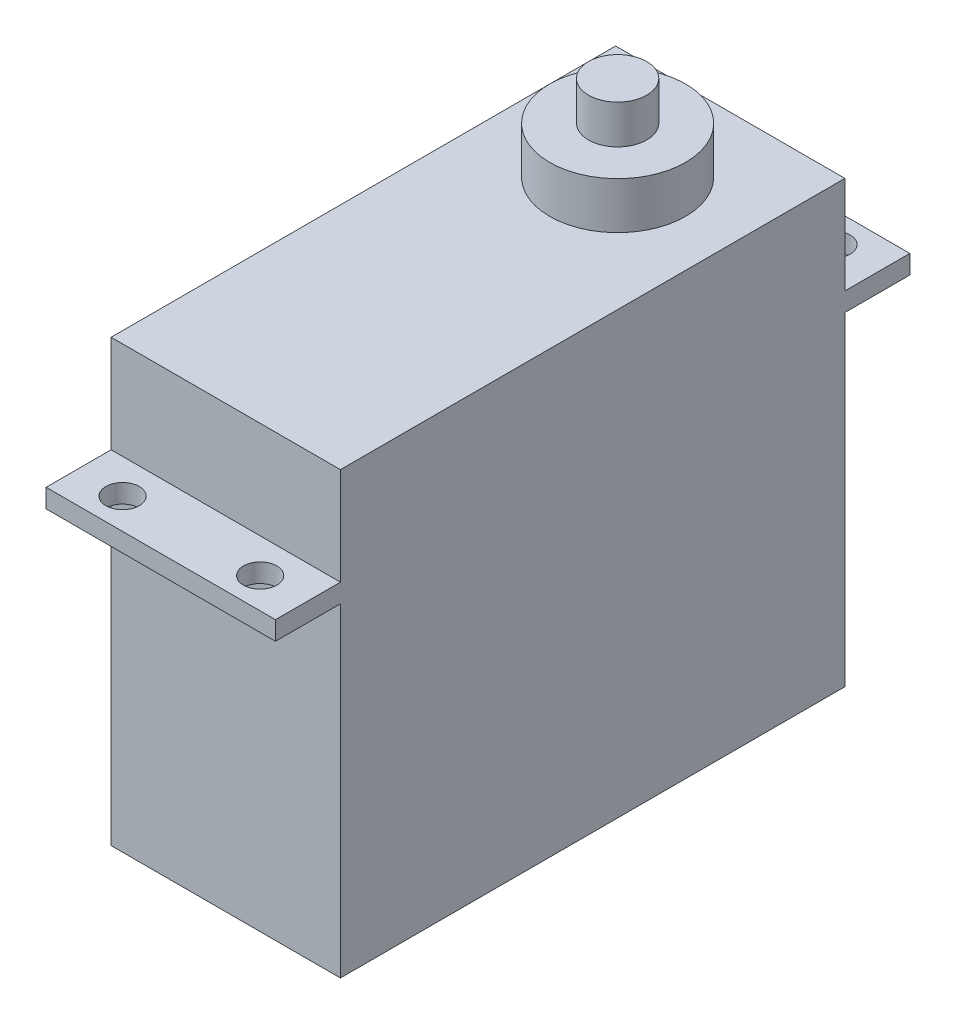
ISO-10303-21;
HEADER;
FILE_DESCRIPTION(('STEP AP214'),'2;1');
FILE_NAME('part.step','',(''),(''),'','','');
FILE_SCHEMA(('AUTOMOTIVE_DESIGN { 1 0 10303 214 1 1 1 1 }'));
ENDSEC;
DATA;
#1=APPLICATION_CONTEXT('core data for automotive mechanical design processes');
#2=APPLICATION_PROTOCOL_DEFINITION('international standard','automotive_design',2000,#1);
#3=PRODUCT_CONTEXT('',#1,'mechanical');
#4=PRODUCT('Part','Part','',(#3));
#5=PRODUCT_RELATED_PRODUCT_CATEGORY('part','',(#4));
#6=PRODUCT_DEFINITION_FORMATION('','',#4);
#7=PRODUCT_DEFINITION_CONTEXT('part definition',#1,'design');
#8=PRODUCT_DEFINITION('design','',#6,#7);
#9=PRODUCT_DEFINITION_SHAPE('','',#8);
#10=(LENGTH_UNIT() NAMED_UNIT(*) SI_UNIT(.MILLI.,.METRE.));
#11=(NAMED_UNIT(*) PLANE_ANGLE_UNIT() SI_UNIT($,.RADIAN.));
#12=(NAMED_UNIT(*) SI_UNIT($,.STERADIAN.) SOLID_ANGLE_UNIT());
#13=UNCERTAINTY_MEASURE_WITH_UNIT(LENGTH_MEASURE(1.E-05),#10,'distance_accuracy_value','');
#14=(GEOMETRIC_REPRESENTATION_CONTEXT(3) GLOBAL_UNCERTAINTY_ASSIGNED_CONTEXT((#13)) GLOBAL_UNIT_ASSIGNED_CONTEXT((#10,
#11,#12)) REPRESENTATION_CONTEXT('',''));
#15=CARTESIAN_POINT('',(0.,0.,0.));
#16=DIRECTION('',(0.,0.,1.));
#17=DIRECTION('',(1.,0.,0.));
#18=AXIS2_PLACEMENT_3D('',#15,#16,#17);
#19=CARTESIAN_POINT('',(0.,63.72,-18.268));
#20=DIRECTION('',(0.,1.,0.));
#21=DIRECTION('',(0.,0.,1.));
#22=AXIS2_PLACEMENT_3D('',#19,#20,#21);
#23=PLANE('',#22);
#24=CARTESIAN_POINT('',(0.,63.72,-18.268));
#25=DIRECTION('',(0.,1.,0.));
#26=DIRECTION('',(0.,0.,1.));
#27=AXIS2_PLACEMENT_3D('',#24,#25,#26);
#28=CIRCLE('',#27,8.88999999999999);
#29=CARTESIAN_POINT('',(0.,63.72,-9.37800000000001));
#30=VERTEX_POINT('',#29);
#31=EDGE_CURVE('E248',#30,#30,#28,.T.);
#32=ORIENTED_EDGE('',*,*,#31,.T.);
#33=EDGE_LOOP('',(#32));
#34=FACE_BOUND('',#33,.T.);
#35=CARTESIAN_POINT('',(0.,63.72,-18.268));
#36=DIRECTION('',(0.,1.,0.));
#37=DIRECTION('',(0.,0.,1.));
#38=AXIS2_PLACEMENT_3D('',#35,#36,#37);
#39=CIRCLE('',#38,3.81);
#40=CARTESIAN_POINT('',(0.,63.72,-14.458));
#41=VERTEX_POINT('',#40);
#42=EDGE_CURVE('E256',#41,#41,#39,.T.);
#43=ORIENTED_EDGE('',*,*,#42,.F.);
#44=EDGE_LOOP('',(#43));
#45=FACE_BOUND('',#44,.T.);
#46=ADVANCED_FACE('F31',(#34,#45),#23,.T.);
#47=CARTESIAN_POINT('',(-15.,57.6,33.));
#48=DIRECTION('',(0.,1.,0.));
#49=DIRECTION('',(0.,0.,1.));
#50=AXIS2_PLACEMENT_3D('',#47,#48,#49);
#51=PLANE('',#50);
#52=DIRECTION('',(0.,0.,1.));
#53=VECTOR('',#52,1.);
#54=CARTESIAN_POINT('',(-15.,57.6,-33.));
#55=LINE('',#54,#53);
#56=CARTESIAN_POINT('',(-15.,57.6,-33.));
#57=VERTEX_POINT('',#56);
#58=CARTESIAN_POINT('',(-15.,57.6,33.));
#59=VERTEX_POINT('',#58);
#60=EDGE_CURVE('E457',#57,#59,#55,.T.);
#61=ORIENTED_EDGE('',*,*,#60,.T.);
#62=DIRECTION('',(1.,0.,0.));
#63=VECTOR('',#62,1.);
#64=CARTESIAN_POINT('',(-15.,57.6,33.));
#65=LINE('',#64,#63);
#66=CARTESIAN_POINT('',(15.,57.6,33.));
#67=VERTEX_POINT('',#66);
#68=EDGE_CURVE('E490',#59,#67,#65,.T.);
#69=ORIENTED_EDGE('',*,*,#68,.T.);
#70=DIRECTION('',(0.,0.,-1.));
#71=VECTOR('',#70,1.);
#72=CARTESIAN_POINT('',(15.,57.6,-33.));
#73=LINE('',#72,#71);
#74=CARTESIAN_POINT('',(15.,57.6,-33.));
#75=VERTEX_POINT('',#74);
#76=EDGE_CURVE('E491',#67,#75,#73,.T.);
#77=ORIENTED_EDGE('',*,*,#76,.T.);
#78=DIRECTION('',(-1.,0.,0.));
#79=VECTOR('',#78,1.);
#80=CARTESIAN_POINT('',(-15.,57.6,-33.));
#81=LINE('',#80,#79);
#82=EDGE_CURVE('E451',#75,#57,#81,.T.);
#83=ORIENTED_EDGE('',*,*,#82,.T.);
#84=EDGE_LOOP('',(#61,#69,#77,#83));
#85=FACE_BOUND('',#84,.T.);
#86=CARTESIAN_POINT('',(0.,57.6,-18.268));
#87=DIRECTION('',(0.,1.,0.));
#88=DIRECTION('',(0.,0.,1.));
#89=AXIS2_PLACEMENT_3D('',#86,#87,#88);
#90=CIRCLE('',#89,8.88999999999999);
#91=CARTESIAN_POINT('',(0.,57.6,-9.37800000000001));
#92=VERTEX_POINT('',#91);
#93=EDGE_CURVE('E251',#92,#92,#90,.T.);
#94=ORIENTED_EDGE('',*,*,#93,.F.);
#95=EDGE_LOOP('',(#94));
#96=FACE_BOUND('',#95,.T.);
#97=ADVANCED_FACE('F211',(#85,#96),#51,.T.);
#98=CARTESIAN_POINT('',(-15.,42.4,41.5));
#99=DIRECTION('',(0.,1.,0.));
#100=DIRECTION('',(0.,0.,1.));
#101=AXIS2_PLACEMENT_3D('',#98,#99,#100);
#102=PLANE('',#101);
#103=DIRECTION('',(1.,0.,0.));
#104=VECTOR('',#103,1.);
#105=CARTESIAN_POINT('',(-15.,42.4,33.));
#106=LINE('',#105,#104);
#107=CARTESIAN_POINT('',(-15.,42.4,33.));
#108=VERTEX_POINT('',#107);
#109=CARTESIAN_POINT('',(15.,42.4,33.));
#110=VERTEX_POINT('',#109);
#111=EDGE_CURVE('E56',#108,#110,#106,.T.);
#112=ORIENTED_EDGE('',*,*,#111,.T.);
#113=DIRECTION('',(0.,0.,-1.));
#114=VECTOR('',#113,1.);
#115=CARTESIAN_POINT('',(15.,42.4,41.5));
#116=LINE('',#115,#114);
#117=CARTESIAN_POINT('',(15.,42.4,41.5));
#118=VERTEX_POINT('',#117);
#119=EDGE_CURVE('E448',#118,#110,#116,.T.);
#120=ORIENTED_EDGE('',*,*,#119,.F.);
#121=DIRECTION('',(1.,0.,0.));
#122=VECTOR('',#121,1.);
#123=CARTESIAN_POINT('',(-15.,42.4,41.5));
#124=LINE('',#123,#122);
#125=CARTESIAN_POINT('',(-15.,42.4,41.5));
#126=VERTEX_POINT('',#125);
#127=EDGE_CURVE('E518',#126,#118,#124,.T.);
#128=ORIENTED_EDGE('',*,*,#127,.F.);
#129=DIRECTION('',(0.,0.,-1.));
#130=VECTOR('',#129,1.);
#131=CARTESIAN_POINT('',(-15.,42.4,41.5));
#132=LINE('',#131,#130);
#133=EDGE_CURVE('E443',#126,#108,#132,.T.);
#134=ORIENTED_EDGE('',*,*,#133,.T.);
#135=EDGE_LOOP('',(#112,#120,#128,#134));
#136=FACE_BOUND('',#135,.T.);
#137=CARTESIAN_POINT('',(9.,42.4,37.5));
#138=DIRECTION('',(0.,1.,0.));
#139=DIRECTION('',(0.,0.,1.));
#140=AXIS2_PLACEMENT_3D('',#137,#138,#139);
#141=CIRCLE('',#140,2.1844);
#142=CARTESIAN_POINT('',(9.,42.4,39.6844));
#143=VERTEX_POINT('',#142);
#144=EDGE_CURVE('E157',#143,#143,#141,.T.);
#145=ORIENTED_EDGE('',*,*,#144,.T.);
#146=EDGE_LOOP('',(#145));
#147=FACE_BOUND('',#146,.T.);
#148=CARTESIAN_POINT('',(-9.,42.4,37.5));
#149=DIRECTION('',(0.,1.,0.));
#150=DIRECTION('',(0.,0.,1.));
#151=AXIS2_PLACEMENT_3D('',#148,#149,#150);
#152=CIRCLE('',#151,2.1844);
#153=CARTESIAN_POINT('',(-9.,42.4,39.6844));
#154=VERTEX_POINT('',#153);
#155=EDGE_CURVE('E242',#154,#154,#152,.F.);
#156=ORIENTED_EDGE('',*,*,#155,.F.);
#157=EDGE_LOOP('',(#156));
#158=FACE_BOUND('',#157,.T.);
#159=ADVANCED_FACE('F193',(#136,#147,#158),#102,.F.);
#160=CARTESIAN_POINT('',(-15.,44.85,41.5));
#161=DIRECTION('',(0.,-1.,0.));
#162=DIRECTION('',(0.,0.,-1.));
#163=AXIS2_PLACEMENT_3D('',#160,#161,#162);
#164=PLANE('',#163);
#165=DIRECTION('',(-1.,0.,0.));
#166=VECTOR('',#165,1.);
#167=CARTESIAN_POINT('',(-15.,44.85,33.));
#168=LINE('',#167,#166);
#169=CARTESIAN_POINT('',(15.,44.85,33.));
#170=VERTEX_POINT('',#169);
#171=CARTESIAN_POINT('',(-15.,44.85,33.));
#172=VERTEX_POINT('',#171);
#173=EDGE_CURVE('E477',#170,#172,#168,.T.);
#174=ORIENTED_EDGE('',*,*,#173,.T.);
#175=DIRECTION('',(0.,0.,-1.));
#176=VECTOR('',#175,1.);
#177=CARTESIAN_POINT('',(-15.,44.85,41.5));
#178=LINE('',#177,#176);
#179=CARTESIAN_POINT('',(-15.,44.85,41.5));
#180=VERTEX_POINT('',#179);
#181=EDGE_CURVE('E471',#180,#172,#178,.T.);
#182=ORIENTED_EDGE('',*,*,#181,.F.);
#183=DIRECTION('',(-1.,0.,0.));
#184=VECTOR('',#183,1.);
#185=CARTESIAN_POINT('',(-15.,44.85,41.5));
#186=LINE('',#185,#184);
#187=CARTESIAN_POINT('',(15.,44.85,41.5));
#188=VERTEX_POINT('',#187);
#189=EDGE_CURVE('E476',#188,#180,#186,.T.);
#190=ORIENTED_EDGE('',*,*,#189,.F.);
#191=DIRECTION('',(0.,0.,-1.));
#192=VECTOR('',#191,1.);
#193=CARTESIAN_POINT('',(15.,44.85,41.5));
#194=LINE('',#193,#192);
#195=EDGE_CURVE('E468',#188,#170,#194,.T.);
#196=ORIENTED_EDGE('',*,*,#195,.T.);
#197=EDGE_LOOP('',(#174,#182,#190,#196));
#198=FACE_BOUND('',#197,.T.);
#199=CARTESIAN_POINT('',(9.,44.85,37.5));
#200=DIRECTION('',(0.,1.,0.));
#201=DIRECTION('',(0.,0.,1.));
#202=AXIS2_PLACEMENT_3D('',#199,#200,#201);
#203=CIRCLE('',#202,2.1844);
#204=CARTESIAN_POINT('',(9.,44.85,39.6844));
#205=VERTEX_POINT('',#204);
#206=EDGE_CURVE('E177',#205,#205,#203,.T.);
#207=ORIENTED_EDGE('',*,*,#206,.F.);
#208=EDGE_LOOP('',(#207));
#209=FACE_BOUND('',#208,.T.);
#210=CARTESIAN_POINT('',(-9.,44.85,37.5));
#211=DIRECTION('',(0.,-1.,0.));
#212=DIRECTION('',(0.,0.,1.));
#213=AXIS2_PLACEMENT_3D('',#210,#211,#212);
#214=CIRCLE('',#213,2.1844);
#215=CARTESIAN_POINT('',(-9.,44.85,39.6844));
#216=VERTEX_POINT('',#215);
#217=EDGE_CURVE('E244',#216,#216,#214,.T.);
#218=ORIENTED_EDGE('',*,*,#217,.T.);
#219=EDGE_LOOP('',(#218));
#220=FACE_BOUND('',#219,.T.);
#221=ADVANCED_FACE('F326',(#198,#209,#220),#164,.F.);
#222=CARTESIAN_POINT('',(-15.,44.85,-41.5));
#223=DIRECTION('',(0.,1.,0.));
#224=DIRECTION('',(0.,0.,1.));
#225=AXIS2_PLACEMENT_3D('',#222,#223,#224);
#226=PLANE('',#225);
#227=CARTESIAN_POINT('',(-9.,44.85,-37.5));
#228=DIRECTION('',(0.,1.,0.));
#229=DIRECTION('',(0.,0.,-1.));
#230=AXIS2_PLACEMENT_3D('',#227,#228,#229);
#231=CIRCLE('',#230,2.1844);
#232=CARTESIAN_POINT('',(-9.,44.85,-39.6844));
#233=VERTEX_POINT('',#232);
#234=EDGE_CURVE('E187',#233,#233,#231,.T.);
#235=ORIENTED_EDGE('',*,*,#234,.F.);
#236=EDGE_LOOP('',(#235));
#237=FACE_BOUND('',#236,.T.);
#238=DIRECTION('',(-1.,0.,0.));
#239=VECTOR('',#238,1.);
#240=CARTESIAN_POINT('',(-15.,44.85,-33.));
#241=LINE('',#240,#239);
#242=CARTESIAN_POINT('',(15.,44.85,-33.));
#243=VERTEX_POINT('',#242);
#244=CARTESIAN_POINT('',(-15.,44.85,-33.));
#245=VERTEX_POINT('',#244);
#246=EDGE_CURVE('E155',#243,#245,#241,.T.);
#247=ORIENTED_EDGE('',*,*,#246,.F.);
#248=DIRECTION('',(0.,0.,1.));
#249=VECTOR('',#248,1.);
#250=CARTESIAN_POINT('',(15.,44.85,-41.5));
#251=LINE('',#250,#249);
#252=CARTESIAN_POINT('',(15.,44.85,-41.5));
#253=VERTEX_POINT('',#252);
#254=EDGE_CURVE('E129',#253,#243,#251,.T.);
#255=ORIENTED_EDGE('',*,*,#254,.F.);
#256=DIRECTION('',(-1.,0.,0.));
#257=VECTOR('',#256,1.);
#258=CARTESIAN_POINT('',(-15.,44.85,-41.5));
#259=LINE('',#258,#257);
#260=CARTESIAN_POINT('',(-15.,44.85,-41.5));
#261=VERTEX_POINT('',#260);
#262=EDGE_CURVE('E135',#253,#261,#259,.T.);
#263=ORIENTED_EDGE('',*,*,#262,.T.);
#264=DIRECTION('',(0.,0.,1.));
#265=VECTOR('',#264,1.);
#266=CARTESIAN_POINT('',(-15.,44.85,-41.5));
#267=LINE('',#266,#265);
#268=EDGE_CURVE('E48',#261,#245,#267,.T.);
#269=ORIENTED_EDGE('',*,*,#268,.T.);
#270=EDGE_LOOP('',(#247,#255,#263,#269));
#271=FACE_BOUND('',#270,.T.);
#272=CARTESIAN_POINT('',(9.,44.85,-37.5));
#273=DIRECTION('',(0.,-1.,0.));
#274=DIRECTION('',(0.,0.,-1.));
#275=AXIS2_PLACEMENT_3D('',#272,#273,#274);
#276=CIRCLE('',#275,2.1844);
#277=CARTESIAN_POINT('',(9.,44.85,-39.6844));
#278=VERTEX_POINT('',#277);
#279=EDGE_CURVE('E178',#278,#278,#276,.T.);
#280=ORIENTED_EDGE('',*,*,#279,.T.);
#281=EDGE_LOOP('',(#280));
#282=FACE_BOUND('',#281,.T.);
#283=ADVANCED_FACE('F141',(#237,#271,#282),#226,.T.);
#284=CARTESIAN_POINT('',(-15.,42.4,-41.5));
#285=DIRECTION('',(0.,-1.,0.));
#286=DIRECTION('',(0.,0.,-1.));
#287=AXIS2_PLACEMENT_3D('',#284,#285,#286);
#288=PLANE('',#287);
#289=CARTESIAN_POINT('',(-9.,42.4,-37.5));
#290=DIRECTION('',(0.,-1.,0.));
#291=DIRECTION('',(0.,0.,-1.));
#292=AXIS2_PLACEMENT_3D('',#289,#290,#291);
#293=CIRCLE('',#292,2.1844);
#294=CARTESIAN_POINT('',(-9.,42.4,-39.6844));
#295=VERTEX_POINT('',#294);
#296=EDGE_CURVE('E35',#295,#295,#293,.T.);
#297=ORIENTED_EDGE('',*,*,#296,.F.);
#298=EDGE_LOOP('',(#297));
#299=FACE_BOUND('',#298,.T.);
#300=DIRECTION('',(1.,0.,0.));
#301=VECTOR('',#300,1.);
#302=CARTESIAN_POINT('',(-15.,42.4,-33.));
#303=LINE('',#302,#301);
#304=CARTESIAN_POINT('',(-15.,42.4,-33.));
#305=VERTEX_POINT('',#304);
#306=CARTESIAN_POINT('',(15.,42.4,-33.));
#307=VERTEX_POINT('',#306);
#308=EDGE_CURVE('E139',#305,#307,#303,.T.);
#309=ORIENTED_EDGE('',*,*,#308,.F.);
#310=DIRECTION('',(0.,0.,1.));
#311=VECTOR('',#310,1.);
#312=CARTESIAN_POINT('',(-15.,42.4,-41.5));
#313=LINE('',#312,#311);
#314=CARTESIAN_POINT('',(-15.,42.4,-41.5));
#315=VERTEX_POINT('',#314);
#316=EDGE_CURVE('E149',#315,#305,#313,.T.);
#317=ORIENTED_EDGE('',*,*,#316,.F.);
#318=DIRECTION('',(1.,0.,0.));
#319=VECTOR('',#318,1.);
#320=CARTESIAN_POINT('',(-15.,42.4,-41.5));
#321=LINE('',#320,#319);
#322=CARTESIAN_POINT('',(15.,42.4,-41.5));
#323=VERTEX_POINT('',#322);
#324=EDGE_CURVE('E138',#315,#323,#321,.T.);
#325=ORIENTED_EDGE('',*,*,#324,.T.);
#326=DIRECTION('',(0.,0.,1.));
#327=VECTOR('',#326,1.);
#328=CARTESIAN_POINT('',(15.,42.4,-41.5));
#329=LINE('',#328,#327);
#330=EDGE_CURVE('E165',#323,#307,#329,.T.);
#331=ORIENTED_EDGE('',*,*,#330,.T.);
#332=EDGE_LOOP('',(#309,#317,#325,#331));
#333=FACE_BOUND('',#332,.T.);
#334=CARTESIAN_POINT('',(9.,42.4,-37.5));
#335=DIRECTION('',(0.,-1.,0.));
#336=DIRECTION('',(0.,0.,-1.));
#337=AXIS2_PLACEMENT_3D('',#334,#335,#336);
#338=CIRCLE('',#337,2.1844);
#339=CARTESIAN_POINT('',(9.,42.4,-39.6844));
#340=VERTEX_POINT('',#339);
#341=EDGE_CURVE('E175',#340,#340,#338,.F.);
#342=ORIENTED_EDGE('',*,*,#341,.T.);
#343=EDGE_LOOP('',(#342));
#344=FACE_BOUND('',#343,.T.);
#345=ADVANCED_FACE('F309',(#299,#333,#344),#288,.T.);
#346=CARTESIAN_POINT('',(-15.,57.6,-33.));
#347=DIRECTION('',(0.,0.,1.));
#348=DIRECTION('',(1.,0.,0.));
#349=AXIS2_PLACEMENT_3D('',#346,#347,#348);
#350=PLANE('',#349);
#351=DIRECTION('',(0.,-1.,0.));
#352=VECTOR('',#351,1.);
#353=CARTESIAN_POINT('',(-15.,57.6,-33.));
#354=LINE('',#353,#352);
#355=CARTESIAN_POINT('',(-15.,0.,-33.));
#356=VERTEX_POINT('',#355);
#357=EDGE_CURVE('E463',#305,#356,#354,.T.);
#358=ORIENTED_EDGE('',*,*,#357,.F.);
#359=ORIENTED_EDGE('',*,*,#308,.T.);
#360=DIRECTION('',(0.,-1.,0.));
#361=VECTOR('',#360,1.);
#362=CARTESIAN_POINT('',(15.,57.6,-33.));
#363=LINE('',#362,#361);
#364=CARTESIAN_POINT('',(15.,0.,-33.));
#365=VERTEX_POINT('',#364);
#366=EDGE_CURVE('E158',#307,#365,#363,.T.);
#367=ORIENTED_EDGE('',*,*,#366,.T.);
#368=DIRECTION('',(-1.,0.,0.));
#369=VECTOR('',#368,1.);
#370=CARTESIAN_POINT('',(-15.,0.,-33.));
#371=LINE('',#370,#369);
#372=EDGE_CURVE('E440',#365,#356,#371,.T.);
#373=ORIENTED_EDGE('',*,*,#372,.T.);
#374=EDGE_LOOP('',(#358,#359,#367,#373));
#375=FACE_BOUND('',#374,.T.);
#376=ADVANCED_FACE('F314',(#375),#350,.F.);
#377=CARTESIAN_POINT('',(-15.,57.6,33.));
#378=DIRECTION('',(0.,0.,-1.));
#379=DIRECTION('',(-1.,0.,0.));
#380=AXIS2_PLACEMENT_3D('',#377,#378,#379);
#381=PLANE('',#380);
#382=ORIENTED_EDGE('',*,*,#173,.F.);
#383=DIRECTION('',(0.,-1.,0.));
#384=VECTOR('',#383,1.);
#385=CARTESIAN_POINT('',(15.,57.6,33.));
#386=LINE('',#385,#384);
#387=EDGE_CURVE('E503',#67,#170,#386,.T.);
#388=ORIENTED_EDGE('',*,*,#387,.F.);
#389=ORIENTED_EDGE('',*,*,#68,.F.);
#390=DIRECTION('',(0.,-1.,0.));
#391=VECTOR('',#390,1.);
#392=CARTESIAN_POINT('',(-15.,57.6,33.));
#393=LINE('',#392,#391);
#394=EDGE_CURVE('E11',#59,#172,#393,.T.);
#395=ORIENTED_EDGE('',*,*,#394,.T.);
#396=EDGE_LOOP('',(#382,#388,#389,#395));
#397=FACE_BOUND('',#396,.T.);
#398=ADVANCED_FACE('F401',(#397),#381,.F.);
#399=ORIENTED_EDGE('',*,*,#111,.F.);
#400=CARTESIAN_POINT('',(-15.,0.,33.));
#401=VERTEX_POINT('',#400);
#402=EDGE_CURVE('E40',#108,#401,#393,.T.);
#403=ORIENTED_EDGE('',*,*,#402,.T.);
#404=DIRECTION('',(1.,0.,0.));
#405=VECTOR('',#404,1.);
#406=CARTESIAN_POINT('',(-15.,0.,33.));
#407=LINE('',#406,#405);
#408=CARTESIAN_POINT('',(15.,0.,33.));
#409=VERTEX_POINT('',#408);
#410=EDGE_CURVE('E442',#401,#409,#407,.T.);
#411=ORIENTED_EDGE('',*,*,#410,.T.);
#412=EDGE_CURVE('E500',#110,#409,#386,.T.);
#413=ORIENTED_EDGE('',*,*,#412,.F.);
#414=EDGE_LOOP('',(#399,#403,#411,#413));
#415=FACE_BOUND('',#414,.T.);
#416=ADVANCED_FACE('F392',(#415),#381,.F.);
#417=CARTESIAN_POINT('',(-15.,57.6,-33.));
#418=DIRECTION('',(1.,0.,0.));
#419=DIRECTION('',(0.,0.,-1.));
#420=AXIS2_PLACEMENT_3D('',#417,#418,#419);
#421=PLANE('',#420);
#422=DIRECTION('',(0.,0.,1.));
#423=VECTOR('',#422,1.);
#424=CARTESIAN_POINT('',(-15.,0.,-33.));
#425=LINE('',#424,#423);
#426=EDGE_CURVE('E437',#356,#401,#425,.T.);
#427=ORIENTED_EDGE('',*,*,#426,.T.);
#428=ORIENTED_EDGE('',*,*,#402,.F.);
#429=ORIENTED_EDGE('',*,*,#133,.F.);
#430=DIRECTION('',(0.,-1.,0.));
#431=VECTOR('',#430,1.);
#432=CARTESIAN_POINT('',(-15.,44.85,41.5));
#433=LINE('',#432,#431);
#434=EDGE_CURVE('E481',#180,#126,#433,.T.);
#435=ORIENTED_EDGE('',*,*,#434,.F.);
#436=ORIENTED_EDGE('',*,*,#181,.T.);
#437=ORIENTED_EDGE('',*,*,#394,.F.);
#438=ORIENTED_EDGE('',*,*,#60,.F.);
#439=EDGE_CURVE('E128',#57,#245,#354,.T.);
#440=ORIENTED_EDGE('',*,*,#439,.T.);
#441=ORIENTED_EDGE('',*,*,#268,.F.);
#442=DIRECTION('',(0.,-1.,0.));
#443=VECTOR('',#442,1.);
#444=CARTESIAN_POINT('',(-15.,44.85,-41.5));
#445=LINE('',#444,#443);
#446=EDGE_CURVE('E124',#261,#315,#445,.T.);
#447=ORIENTED_EDGE('',*,*,#446,.T.);
#448=ORIENTED_EDGE('',*,*,#316,.T.);
#449=ORIENTED_EDGE('',*,*,#357,.T.);
#450=EDGE_LOOP('',(#427,#428,#429,#435,#436,#437,#438,#440,#441,#447,#448,#449));
#451=FACE_BOUND('',#450,.T.);
#452=ADVANCED_FACE('F33',(#451),#421,.F.);
#453=CARTESIAN_POINT('',(15.,57.6,-33.));
#454=DIRECTION('',(-1.,0.,0.));
#455=DIRECTION('',(0.,0.,1.));
#456=AXIS2_PLACEMENT_3D('',#453,#454,#455);
#457=PLANE('',#456);
#458=DIRECTION('',(0.,0.,-1.));
#459=VECTOR('',#458,1.);
#460=CARTESIAN_POINT('',(15.,0.,-33.));
#461=LINE('',#460,#459);
#462=EDGE_CURVE('E445',#409,#365,#461,.T.);
#463=ORIENTED_EDGE('',*,*,#462,.T.);
#464=ORIENTED_EDGE('',*,*,#366,.F.);
#465=ORIENTED_EDGE('',*,*,#330,.F.);
#466=DIRECTION('',(0.,1.,0.));
#467=VECTOR('',#466,1.);
#468=CARTESIAN_POINT('',(15.,44.85,-41.5));
#469=LINE('',#468,#467);
#470=EDGE_CURVE('E143',#323,#253,#469,.T.);
#471=ORIENTED_EDGE('',*,*,#470,.T.);
#472=ORIENTED_EDGE('',*,*,#254,.T.);
#473=EDGE_CURVE('E498',#75,#243,#363,.T.);
#474=ORIENTED_EDGE('',*,*,#473,.F.);
#475=ORIENTED_EDGE('',*,*,#76,.F.);
#476=ORIENTED_EDGE('',*,*,#387,.T.);
#477=ORIENTED_EDGE('',*,*,#195,.F.);
#478=DIRECTION('',(0.,1.,0.));
#479=VECTOR('',#478,1.);
#480=CARTESIAN_POINT('',(15.,44.85,41.5));
#481=LINE('',#480,#479);
#482=EDGE_CURVE('E523',#118,#188,#481,.T.);
#483=ORIENTED_EDGE('',*,*,#482,.F.);
#484=ORIENTED_EDGE('',*,*,#119,.T.);
#485=ORIENTED_EDGE('',*,*,#412,.T.);
#486=EDGE_LOOP('',(#463,#464,#465,#471,#472,#474,#475,#476,#477,#483,#484,#485));
#487=FACE_BOUND('',#486,.T.);
#488=ADVANCED_FACE('F370',(#487),#457,.F.);
#489=ORIENTED_EDGE('',*,*,#473,.T.);
#490=ORIENTED_EDGE('',*,*,#246,.T.);
#491=ORIENTED_EDGE('',*,*,#439,.F.);
#492=ORIENTED_EDGE('',*,*,#82,.F.);
#493=EDGE_LOOP('',(#489,#490,#491,#492));
#494=FACE_BOUND('',#493,.T.);
#495=ADVANCED_FACE('F364',(#494),#350,.F.);
#496=CARTESIAN_POINT('',(-15.,0.,33.));
#497=DIRECTION('',(0.,1.,0.));
#498=DIRECTION('',(0.,0.,1.));
#499=AXIS2_PLACEMENT_3D('',#496,#497,#498);
#500=PLANE('',#499);
#501=ORIENTED_EDGE('',*,*,#426,.F.);
#502=ORIENTED_EDGE('',*,*,#372,.F.);
#503=ORIENTED_EDGE('',*,*,#462,.F.);
#504=ORIENTED_EDGE('',*,*,#410,.F.);
#505=EDGE_LOOP('',(#501,#502,#503,#504));
#506=FACE_BOUND('',#505,.T.);
#507=ADVANCED_FACE('F369',(#506),#500,.F.);
#508=CARTESIAN_POINT('',(-15.,42.4,41.5));
#509=DIRECTION('',(0.,0.,1.));
#510=DIRECTION('',(1.,0.,0.));
#511=AXIS2_PLACEMENT_3D('',#508,#509,#510);
#512=PLANE('',#511);
#513=ORIENTED_EDGE('',*,*,#434,.T.);
#514=ORIENTED_EDGE('',*,*,#127,.T.);
#515=ORIENTED_EDGE('',*,*,#482,.T.);
#516=ORIENTED_EDGE('',*,*,#189,.T.);
#517=EDGE_LOOP('',(#513,#514,#515,#516));
#518=FACE_BOUND('',#517,.T.);
#519=ADVANCED_FACE('F208',(#518),#512,.T.);
#520=CARTESIAN_POINT('',(-15.,42.4,-41.5));
#521=DIRECTION('',(0.,0.,-1.));
#522=DIRECTION('',(1.,0.,0.));
#523=AXIS2_PLACEMENT_3D('',#520,#521,#522);
#524=PLANE('',#523);
#525=ORIENTED_EDGE('',*,*,#446,.F.);
#526=ORIENTED_EDGE('',*,*,#262,.F.);
#527=ORIENTED_EDGE('',*,*,#470,.F.);
#528=ORIENTED_EDGE('',*,*,#324,.F.);
#529=EDGE_LOOP('',(#525,#526,#527,#528));
#530=FACE_BOUND('',#529,.T.);
#531=ADVANCED_FACE('F133',(#530),#524,.T.);
#532=CARTESIAN_POINT('',(9.,-2.50000000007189E-05,37.5));
#533=DIRECTION('',(0.,1.,0.));
#534=DIRECTION('',(0.,0.,1.));
#535=AXIS2_PLACEMENT_3D('',#532,#533,#534);
#536=CYLINDRICAL_SURFACE('',#535,2.1844);
#537=ORIENTED_EDGE('',*,*,#206,.T.);
#538=EDGE_LOOP('',(#537));
#539=FACE_BOUND('',#538,.T.);
#540=ORIENTED_EDGE('',*,*,#144,.F.);
#541=EDGE_LOOP('',(#540));
#542=FACE_BOUND('',#541,.T.);
#543=ADVANCED_FACE('F196',(#539,#542),#536,.F.);
#544=CARTESIAN_POINT('',(9.,-2.50000000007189E-05,-37.5));
#545=DIRECTION('',(0.,1.,0.));
#546=DIRECTION('',(0.,0.,1.));
#547=AXIS2_PLACEMENT_3D('',#544,#545,#546);
#548=CYLINDRICAL_SURFACE('',#547,2.1844);
#549=ORIENTED_EDGE('',*,*,#341,.F.);
#550=EDGE_LOOP('',(#549));
#551=FACE_BOUND('',#550,.T.);
#552=ORIENTED_EDGE('',*,*,#279,.F.);
#553=EDGE_LOOP('',(#552));
#554=FACE_BOUND('',#553,.T.);
#555=ADVANCED_FACE('F198',(#551,#554),#548,.F.);
#556=CARTESIAN_POINT('',(-9.,-2.50000000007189E-05,-37.5));
#557=DIRECTION('',(0.,1.,0.));
#558=DIRECTION('',(0.,0.,1.));
#559=AXIS2_PLACEMENT_3D('',#556,#557,#558);
#560=CYLINDRICAL_SURFACE('',#559,2.1844);
#561=ORIENTED_EDGE('',*,*,#296,.T.);
#562=EDGE_LOOP('',(#561));
#563=FACE_BOUND('',#562,.T.);
#564=ORIENTED_EDGE('',*,*,#234,.T.);
#565=EDGE_LOOP('',(#564));
#566=FACE_BOUND('',#565,.T.);
#567=ADVANCED_FACE('F205',(#563,#566),#560,.F.);
#568=CARTESIAN_POINT('',(-9.,-2.50000000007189E-05,37.5));
#569=DIRECTION('',(0.,1.,0.));
#570=DIRECTION('',(0.,0.,1.));
#571=AXIS2_PLACEMENT_3D('',#568,#569,#570);
#572=CYLINDRICAL_SURFACE('',#571,2.1844);
#573=ORIENTED_EDGE('',*,*,#217,.F.);
#574=EDGE_LOOP('',(#573));
#575=FACE_BOUND('',#574,.T.);
#576=ORIENTED_EDGE('',*,*,#155,.T.);
#577=EDGE_LOOP('',(#576));
#578=FACE_BOUND('',#577,.T.);
#579=ADVANCED_FACE('F228',(#575,#578),#572,.F.);
#580=CARTESIAN_POINT('',(0.,63.72,-18.268));
#581=DIRECTION('',(0.,-1.,0.));
#582=DIRECTION('',(0.,0.,-1.));
#583=AXIS2_PLACEMENT_3D('',#580,#581,#582);
#584=CYLINDRICAL_SURFACE('',#583,8.88999999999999);
#585=ORIENTED_EDGE('',*,*,#31,.F.);
#586=EDGE_LOOP('',(#585));
#587=FACE_BOUND('',#586,.T.);
#588=ORIENTED_EDGE('',*,*,#93,.T.);
#589=EDGE_LOOP('',(#588));
#590=FACE_BOUND('',#589,.T.);
#591=ADVANCED_FACE('F225',(#587,#590),#584,.T.);
#592=CARTESIAN_POINT('',(0.,68.8,-18.268));
#593=DIRECTION('',(0.,-1.,0.));
#594=DIRECTION('',(0.,0.,-1.));
#595=AXIS2_PLACEMENT_3D('',#592,#593,#594);
#596=CYLINDRICAL_SURFACE('',#595,3.81);
#597=CARTESIAN_POINT('',(0.,68.8,-18.268));
#598=DIRECTION('',(0.,1.,0.));
#599=DIRECTION('',(0.,0.,1.));
#600=AXIS2_PLACEMENT_3D('',#597,#598,#599);
#601=CIRCLE('',#600,3.81);
#602=CARTESIAN_POINT('',(0.,68.8,-14.458));
#603=VERTEX_POINT('',#602);
#604=EDGE_CURVE('E254',#603,#603,#601,.T.);
#605=ORIENTED_EDGE('',*,*,#604,.F.);
#606=EDGE_LOOP('',(#605));
#607=FACE_BOUND('',#606,.T.);
#608=ORIENTED_EDGE('',*,*,#42,.T.);
#609=EDGE_LOOP('',(#608));
#610=FACE_BOUND('',#609,.T.);
#611=ADVANCED_FACE('F223',(#607,#610),#596,.T.);
#612=CARTESIAN_POINT('',(0.,68.8,-18.268));
#613=DIRECTION('',(0.,1.,0.));
#614=DIRECTION('',(0.,0.,1.));
#615=AXIS2_PLACEMENT_3D('',#612,#613,#614);
#616=PLANE('',#615);
#617=ORIENTED_EDGE('',*,*,#604,.T.);
#618=EDGE_LOOP('',(#617));
#619=FACE_BOUND('',#618,.T.);
#620=ADVANCED_FACE('F262',(#619),#616,.T.);
#621=CLOSED_SHELL('',(#46,#97,#159,#221,#283,#345,#376,#398,#416,#452,#488,#495,#507,#519,#531,
#543,#555,#567,#579,#591,#611,#620));
#622=MANIFOLD_SOLID_BREP('B2',#621);
#623=ADVANCED_BREP_SHAPE_REPRESENTATION('',(#18,#622),#14);
#624=SHAPE_DEFINITION_REPRESENTATION(#9,#623);
ENDSEC;
END-ISO-10303-21;
